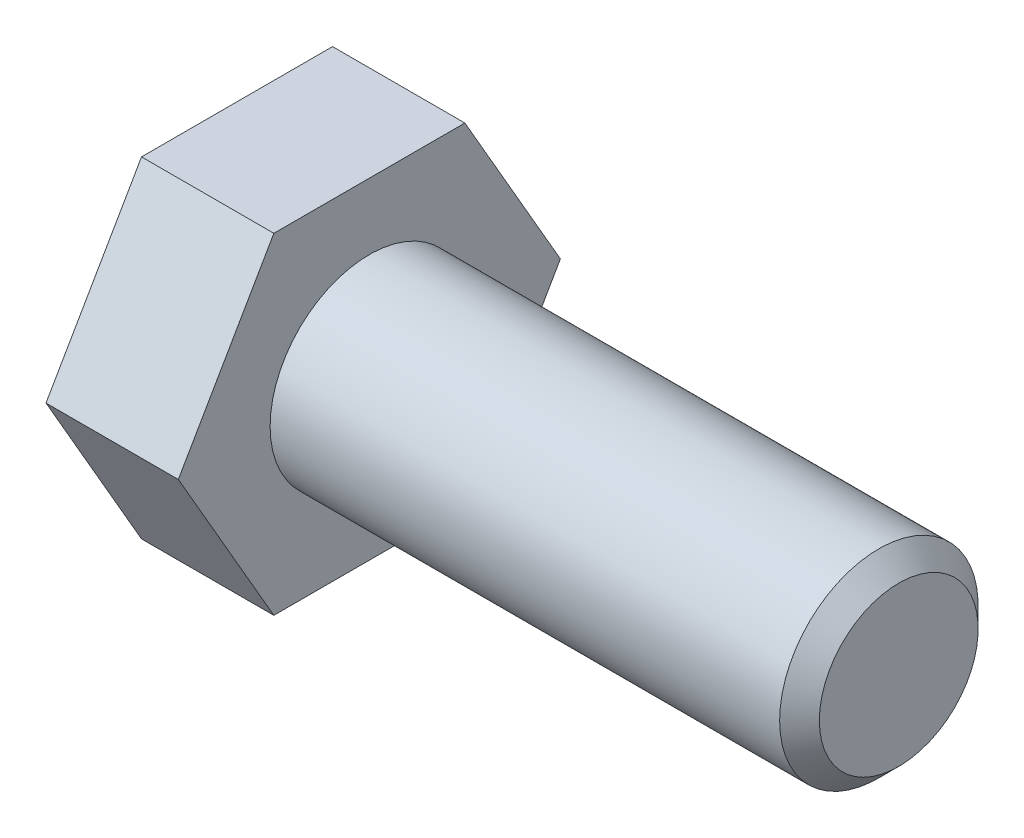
from build123d import *

# Parameters (mm, degrees)
SKIZZE2_OUTSIDE_W               = 11.814
SKIZZE2_OUTSIDE_H               = 11.814
SCHNITT_LINEAR_AUSTRAGEN1_DEPTH = 12.157956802
FASE1_SIZE                      = 0.3


with BuildPart() as part:
    # Skizze1 → Rotation1 (revolve)
    with BuildSketch(Plane.XY, mode=Mode.PRIVATE) as rotation1_sk:
        Polygon((10, 0), (10, 1.5), (2, 1.5), (2, 3.5), (0, 3.5), (0, 0), align=None)
    revolve(rotation1_sk.sketch.rotate(Axis((0, 0, 0), (1, 0, 0)), 90), axis=Axis((0, 0, 0), (1, 0, 0)))

    # Skizze2 outside → Schnitt-Linear austragen1 (cut, through all)
    with BuildSketch(Plane.ZY):
        Rectangle(SKIZZE2_OUTSIDE_W, SKIZZE2_OUTSIDE_H)
        Polygon((1.443375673, 2.5), (-1.443375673, 2.5), (-2.886751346, 0), (-1.443375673, -2.5), (1.443375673, -2.5), (2.886751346, 0), align=None, mode=Mode.SUBTRACT)
    extrude(amount=-SCHNITT_LINEAR_AUSTRAGEN1_DEPTH, mode=Mode.SUBTRACT)

    # Fase1
    fase1_edges = [part.edges().sort_by_distance(p)[0] for p in [
        (10, 0, -1.5),
    ]]
    chamfer(fase1_edges, length=FASE1_SIZE)


solid = part.part
